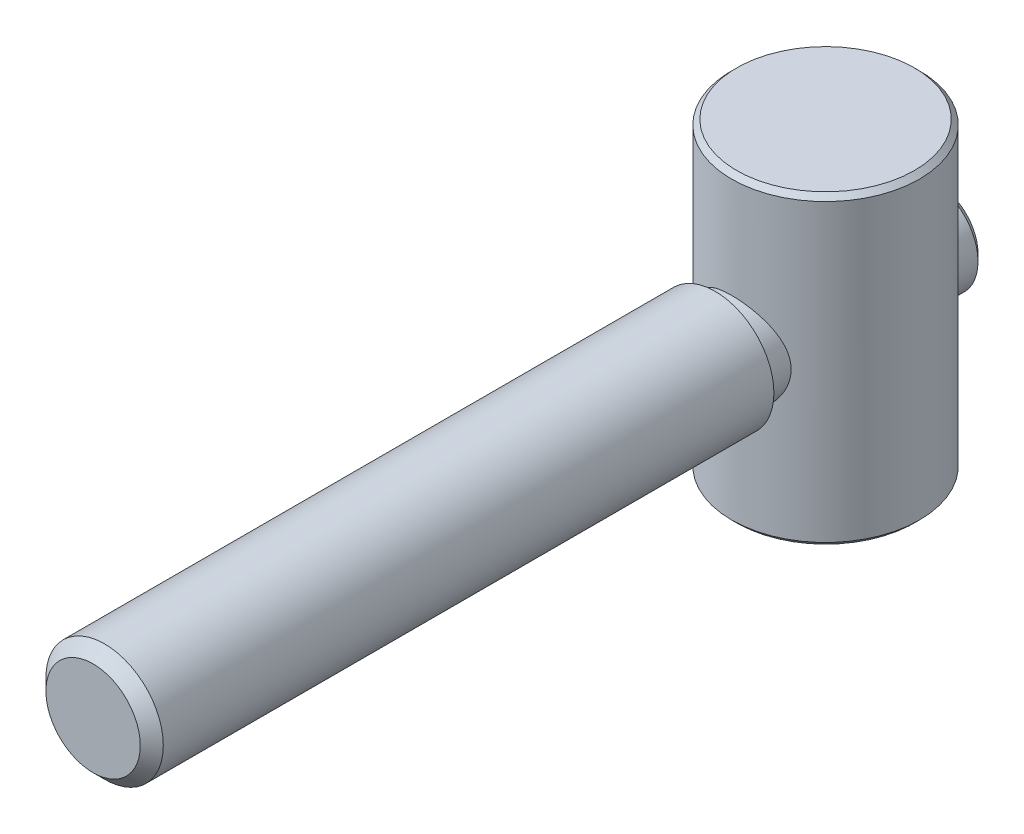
ISO-10303-21;
HEADER;
FILE_DESCRIPTION(('STEP AP214'),'2;1');
FILE_NAME('part.step','',(''),(''),'','','');
FILE_SCHEMA(('AUTOMOTIVE_DESIGN { 1 0 10303 214 1 1 1 1 }'));
ENDSEC;
DATA;
#1=APPLICATION_CONTEXT('core data for automotive mechanical design processes');
#2=APPLICATION_PROTOCOL_DEFINITION('international standard','automotive_design',2000,#1);
#3=PRODUCT_CONTEXT('',#1,'mechanical');
#4=PRODUCT('Part','Part','',(#3));
#5=PRODUCT_RELATED_PRODUCT_CATEGORY('part','',(#4));
#6=PRODUCT_DEFINITION_FORMATION('','',#4);
#7=PRODUCT_DEFINITION_CONTEXT('part definition',#1,'design');
#8=PRODUCT_DEFINITION('design','',#6,#7);
#9=PRODUCT_DEFINITION_SHAPE('','',#8);
#10=(LENGTH_UNIT() NAMED_UNIT(*) SI_UNIT(.MILLI.,.METRE.));
#11=(NAMED_UNIT(*) PLANE_ANGLE_UNIT() SI_UNIT($,.RADIAN.));
#12=(NAMED_UNIT(*) SI_UNIT($,.STERADIAN.) SOLID_ANGLE_UNIT());
#13=UNCERTAINTY_MEASURE_WITH_UNIT(LENGTH_MEASURE(1.E-05),#10,'distance_accuracy_value','');
#14=(GEOMETRIC_REPRESENTATION_CONTEXT(3) GLOBAL_UNCERTAINTY_ASSIGNED_CONTEXT((#13)) GLOBAL_UNIT_ASSIGNED_CONTEXT((#10,
#11,#12)) REPRESENTATION_CONTEXT('',''));
#15=CARTESIAN_POINT('',(0.,0.,0.));
#16=DIRECTION('',(0.,0.,1.));
#17=DIRECTION('',(1.,0.,0.));
#18=AXIS2_PLACEMENT_3D('',#15,#16,#17);
#19=CARTESIAN_POINT('',(0.,0.,-16.2));
#20=DIRECTION('',(0.,0.,1.));
#21=DIRECTION('',(1.,0.,0.));
#22=AXIS2_PLACEMENT_3D('',#19,#20,#21);
#23=PLANE('',#22);
#24=DIRECTION('',(0.,-1.,0.));
#25=VECTOR('',#24,1.);
#26=CARTESIAN_POINT('',(0.4,0.,-16.2));
#27=LINE('',#26,#25);
#28=CARTESIAN_POINT('',(0.4,1.64558264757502,-16.2));
#29=VERTEX_POINT('',#28);
#30=CARTESIAN_POINT('',(0.4,-1.64558264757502,-16.2));
#31=VERTEX_POINT('',#30);
#32=EDGE_CURVE('E116',#29,#31,#27,.T.);
#33=ORIENTED_EDGE('',*,*,#32,.F.);
#34=CARTESIAN_POINT('',(0.,0.,-16.2));
#35=DIRECTION('',(0.,0.,1.));
#36=DIRECTION('',(1.,0.,0.));
#37=AXIS2_PLACEMENT_3D('',#34,#35,#36);
#38=CIRCLE('',#37,1.6935);
#39=EDGE_CURVE('E233',#31,#29,#38,.T.);
#40=ORIENTED_EDGE('',*,*,#39,.F.);
#41=EDGE_LOOP('',(#33,#40));
#42=FACE_BOUND('',#41,.T.);
#43=ADVANCED_FACE('F14',(#42),#23,.F.);
#44=CARTESIAN_POINT('',(0.,0.,-16.2));
#45=DIRECTION('',(0.,0.,1.));
#46=DIRECTION('',(1.,0.,0.));
#47=AXIS2_PLACEMENT_3D('',#44,#45,#46);
#48=CONICAL_SURFACE('',#47,1.6935,0.785398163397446);
#49=CARTESIAN_POINT('',(0.4,1.96030622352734,-15.8928));
#50=CARTESIAN_POINT('',(0.4,1.91220040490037,-15.9399326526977));
#51=CARTESIAN_POINT('',(0.4,1.86406179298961,-15.987031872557));
#52=CARTESIAN_POINT('',(0.4,1.76762008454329,-16.0812165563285));
#53=CARTESIAN_POINT('',(0.4,1.71931684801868,-16.1283018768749));
#54=CARTESIAN_POINT('',(0.4,1.62128853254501,-16.2236371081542));
#55=CARTESIAN_POINT('',(0.4,1.5715604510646,-16.2718839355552));
#56=CARTESIAN_POINT('',(0.4,1.47203148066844,-16.3681410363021));
#57=CARTESIAN_POINT('',(0.4,1.42223083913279,-16.4161515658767));
#58=CARTESIAN_POINT('',(0.4,1.27910635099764,-16.5535705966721));
#59=CARTESIAN_POINT('',(0.4,1.18553880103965,-16.6427271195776));
#60=CARTESIAN_POINT('',(0.4,1.04389226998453,-16.7757107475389));
#61=CARTESIAN_POINT('',(0.4,0.996302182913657,-16.8200580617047));
#62=CARTESIAN_POINT('',(0.4,0.900663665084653,-16.908185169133));
#63=CARTESIAN_POINT('',(0.4,0.852615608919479,-16.9519653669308));
#64=CARTESIAN_POINT('',(0.4,0.757010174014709,-17.0375656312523));
#65=CARTESIAN_POINT('',(0.4,0.709472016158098,-17.0794071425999));
#66=CARTESIAN_POINT('',(0.4,0.613103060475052,-17.1618876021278));
#67=CARTESIAN_POINT('',(0.4,0.564268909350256,-17.202522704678));
#68=CARTESIAN_POINT('',(0.4,0.489794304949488,-17.2613006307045));
#69=CARTESIAN_POINT('',(0.4,0.464926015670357,-17.2804170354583));
#70=CARTESIAN_POINT('',(0.4,0.414504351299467,-17.317718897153));
#71=CARTESIAN_POINT('',(0.4,0.388951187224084,-17.3359046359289));
#72=CARTESIAN_POINT('',(0.4,0.337021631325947,-17.3708007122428));
#73=CARTESIAN_POINT('',(0.4,0.310649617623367,-17.387517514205));
#74=CARTESIAN_POINT('',(0.4,0.256646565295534,-17.4187557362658));
#75=CARTESIAN_POINT('',(0.4,0.229017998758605,-17.4332812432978));
#76=CARTESIAN_POINT('',(0.4,0.194529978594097,-17.4487382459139));
#77=CARTESIAN_POINT('',(0.4,0.188431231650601,-17.451374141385));
#78=CARTESIAN_POINT('',(0.4,0.176155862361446,-17.456465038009));
#79=CARTESIAN_POINT('',(0.4,0.169979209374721,-17.4589199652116));
#80=CARTESIAN_POINT('',(0.4,0.15133633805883,-17.4659833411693));
#81=CARTESIAN_POINT('',(0.4,0.138753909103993,-17.4702918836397));
#82=CARTESIAN_POINT('',(0.4,0.113503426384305,-17.4778793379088));
#83=CARTESIAN_POINT('',(0.4,0.100840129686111,-17.4811739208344));
#84=CARTESIAN_POINT('',(0.4,0.0752707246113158,-17.4866710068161));
#85=CARTESIAN_POINT('',(0.4,0.0623645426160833,-17.4888731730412));
#86=CARTESIAN_POINT('',(0.4,0.0361451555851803,-17.4920845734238));
#87=CARTESIAN_POINT('',(0.4,0.0228289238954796,-17.4930696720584));
#88=CARTESIAN_POINT('',(0.4,-0.00382941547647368,-17.4937047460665));
#89=CARTESIAN_POINT('',(0.4,-0.0171715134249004,-17.4933551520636));
#90=CARTESIAN_POINT('',(0.4,-0.0570913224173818,-17.4903112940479));
#91=CARTESIAN_POINT('',(0.4,-0.0835282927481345,-17.4856177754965));
#92=CARTESIAN_POINT('',(0.4,-0.144402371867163,-17.4695980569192));
#93=CARTESIAN_POINT('',(0.4,-0.178344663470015,-17.4565077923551));
#94=CARTESIAN_POINT('',(0.4,-0.227667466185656,-17.4334775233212));
#95=CARTESIAN_POINT('',(0.4,-0.24390093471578,-17.4251975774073));
#96=CARTESIAN_POINT('',(0.4,-0.275892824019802,-17.4077659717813));
#97=CARTESIAN_POINT('',(0.4,-0.29165139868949,-17.3986145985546));
#98=CARTESIAN_POINT('',(0.4,-0.342427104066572,-17.367697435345));
#99=CARTESIAN_POINT('',(0.4,-0.376624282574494,-17.3446006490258));
#100=CARTESIAN_POINT('',(0.4,-0.443707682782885,-17.2965614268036));
#101=CARTESIAN_POINT('',(0.4,-0.476592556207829,-17.2716171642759));
#102=CARTESIAN_POINT('',(0.4,-0.541555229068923,-17.2205373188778));
#103=CARTESIAN_POINT('',(0.4,-0.573630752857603,-17.1943988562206));
#104=CARTESIAN_POINT('',(0.4,-0.637167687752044,-17.1413834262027));
#105=CARTESIAN_POINT('',(0.4,-0.66862901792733,-17.1145063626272));
#106=CARTESIAN_POINT('',(0.4,-0.762581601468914,-17.0329492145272));
#107=CARTESIAN_POINT('',(0.4,-0.824422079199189,-16.9775217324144));
#108=CARTESIAN_POINT('',(0.4,-0.947059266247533,-16.865732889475));
#109=CARTESIAN_POINT('',(0.4,-1.0078575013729,-16.8093731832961));
#110=CARTESIAN_POINT('',(0.4,-1.14419995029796,-16.6816912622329));
#111=CARTESIAN_POINT('',(0.4,-1.21957997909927,-16.6101938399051));
#112=CARTESIAN_POINT('',(0.4,-1.36985690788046,-16.4666062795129));
#113=CARTESIAN_POINT('',(0.4,-1.444753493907,-16.3945158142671));
#114=CARTESIAN_POINT('',(0.4,-1.59323885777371,-16.2509244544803));
#115=CARTESIAN_POINT('',(0.4,-1.66683198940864,-16.1794280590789));
#116=CARTESIAN_POINT('',(0.4,-1.81374089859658,-16.0362433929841));
#117=CARTESIAN_POINT('',(0.4,-1.88705682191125,-15.9645552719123));
#118=CARTESIAN_POINT('',(0.4,-1.96030622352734,-15.8928));
#119=B_SPLINE_CURVE_WITH_KNOTS('',3,(#49,#50,#51,#52,#53,#54,#55,#56,#57,#58,#59,#60,#61,#62,
#63,#64,#65,#66,#67,#68,#69,#70,#71,#72,#73,#74,#75,#76,#77,#78,#79,#80,#81,#82,#83,#84,#85,#86,
#87,#88,#89,#90,#91,#92,#93,#94,#95,#96,#97,#98,#99,#100,#101,#102,#103,#104,#105,#106,#107,
#108,#109,#110,#111,#112,#113,#114,#115,#116,#117,#118),.UNSPECIFIED.,.F.,.F.,(4,2,2,2,2,2,2,2,
2,2,2,2,2,2,2,2,2,2,2,2,2,2,2,2,2,2,2,2,2,2,2,2,2,2,4),(0.,0.202041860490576,0.404407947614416,
0.612267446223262,0.819791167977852,1.20751042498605,1.40265824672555,1.59765821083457,
1.78763722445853,1.97816800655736,2.07225481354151,2.16631295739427,2.25993394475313,
2.35337810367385,2.37330754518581,2.39324508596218,2.4331093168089,2.47232228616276,
2.51154733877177,2.55153838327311,2.59151652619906,2.67157438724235,2.78007616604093,
2.83473709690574,2.88938011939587,3.01305301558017,3.13684986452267,3.26096287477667,
3.38509213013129,3.63419872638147,3.88290259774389,4.19457948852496,4.5064417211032,
4.81425453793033,5.1218730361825),.UNSPECIFIED.);
#120=CARTESIAN_POINT('',(0.4,1.95959179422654,-15.8935));
#121=VERTEX_POINT('',#120);
#122=EDGE_CURVE('E104',#121,#29,#119,.T.);
#123=ORIENTED_EDGE('',*,*,#122,.F.);
#124=CARTESIAN_POINT('',(0.,0.,-15.8935));
#125=DIRECTION('',(0.,0.,1.));
#126=DIRECTION('',(1.,0.,0.));
#127=AXIS2_PLACEMENT_3D('',#124,#125,#126);
#128=CIRCLE('',#127,2.);
#129=CARTESIAN_POINT('',(0.4,-1.95959179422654,-15.8935));
#130=VERTEX_POINT('',#129);
#131=EDGE_CURVE('E239',#130,#121,#128,.T.);
#132=ORIENTED_EDGE('',*,*,#131,.F.);
#133=EDGE_CURVE('E117',#31,#130,#119,.T.);
#134=ORIENTED_EDGE('',*,*,#133,.F.);
#135=ORIENTED_EDGE('',*,*,#39,.T.);
#136=EDGE_LOOP('',(#123,#132,#134,#135));
#137=FACE_BOUND('',#136,.T.);
#138=ADVANCED_FACE('F134',(#137),#48,.T.);
#139=CARTESIAN_POINT('',(-0.4,0.,-46.2));
#140=DIRECTION('',(1.,0.,0.));
#141=DIRECTION('',(0.,-1.,0.));
#142=AXIS2_PLACEMENT_3D('',#139,#140,#141);
#143=CYLINDRICAL_SURFACE('',#142,31.5);
#144=CARTESIAN_POINT('',(-0.4,0.,-46.2));
#145=DIRECTION('',(-1.,0.,0.));
#146=DIRECTION('',(0.,1.,0.));
#147=AXIS2_PLACEMENT_3D('',#144,#145,#146);
#148=CIRCLE('',#147,31.5);
#149=CARTESIAN_POINT('',(-0.4,-1.95959179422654,-14.7610114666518));
#150=VERTEX_POINT('',#149);
#151=CARTESIAN_POINT('',(-0.4,1.95959179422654,-14.7610114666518));
#152=VERTEX_POINT('',#151);
#153=EDGE_CURVE('E102',#150,#152,#148,.T.);
#154=ORIENTED_EDGE('',*,*,#153,.T.);
#155=CARTESIAN_POINT('',(-0.4,1.95959179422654,-14.7610114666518));
#156=CARTESIAN_POINT('',(-0.344561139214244,1.97091486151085,-14.7617184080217));
#157=CARTESIAN_POINT('',(-0.28863792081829,1.97987306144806,-14.762281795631));
#158=CARTESIAN_POINT('',(-0.176213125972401,1.99302430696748,-14.7631121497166));
#159=CARTESIAN_POINT('',(-0.119711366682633,1.99721579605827,-14.7633790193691));
#160=CARTESIAN_POINT('',(-0.00749894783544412,2.0007609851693,-14.7636046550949));
#161=CARTESIAN_POINT('',(0.0482092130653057,2.00019410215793,-14.7635684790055));
#162=CARTESIAN_POINT('',(0.159360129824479,1.99441663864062,-14.7632012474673));
#163=CARTESIAN_POINT('',(0.214802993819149,1.98920814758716,-14.7628703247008));
#164=CARTESIAN_POINT('',(0.313516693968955,1.97576492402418,-14.762023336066));
#165=CARTESIAN_POINT('',(0.356906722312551,1.96839158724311,-14.761560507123));
#166=CARTESIAN_POINT('',(0.4,1.95959179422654,-14.7610114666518));
#167=B_SPLINE_CURVE_WITH_KNOTS('',3,(#155,#156,#157,#158,#159,#160,#161,#162,#163,#164,#165,
#166),.UNSPECIFIED.,.F.,.F.,(4,2,2,2,2,4),(0.,0.169712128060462,0.33947965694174,
0.506419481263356,0.673284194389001,0.805229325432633),.UNSPECIFIED.);
#168=CARTESIAN_POINT('',(0.4,1.95959179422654,-14.7610114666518));
#169=VERTEX_POINT('',#168);
#170=EDGE_CURVE('E100',#152,#169,#167,.T.);
#171=ORIENTED_EDGE('',*,*,#170,.T.);
#172=CARTESIAN_POINT('',(0.4,0.,-46.2));
#173=DIRECTION('',(-1.,0.,0.));
#174=DIRECTION('',(0.,1.,0.));
#175=AXIS2_PLACEMENT_3D('',#172,#173,#174);
#176=CIRCLE('',#175,31.5);
#177=CARTESIAN_POINT('',(0.4,-1.95959179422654,-14.7610114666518));
#178=VERTEX_POINT('',#177);
#179=EDGE_CURVE('E86',#178,#169,#176,.T.);
#180=ORIENTED_EDGE('',*,*,#179,.F.);
#181=CARTESIAN_POINT('',(0.4,-1.95959179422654,-14.7610114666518));
#182=CARTESIAN_POINT('',(0.344561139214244,-1.97091486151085,-14.7617184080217));
#183=CARTESIAN_POINT('',(0.28863792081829,-1.97987306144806,-14.762281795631));
#184=CARTESIAN_POINT('',(0.176213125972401,-1.99302430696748,-14.7631121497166));
#185=CARTESIAN_POINT('',(0.119711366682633,-1.99721579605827,-14.7633790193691));
#186=CARTESIAN_POINT('',(0.00749894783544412,-2.0007609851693,-14.7636046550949));
#187=CARTESIAN_POINT('',(-0.0482092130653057,-2.00019410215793,-14.7635684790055));
#188=CARTESIAN_POINT('',(-0.159360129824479,-1.99441663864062,-14.7632012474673));
#189=CARTESIAN_POINT('',(-0.214802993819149,-1.98920814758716,-14.7628703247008));
#190=CARTESIAN_POINT('',(-0.313516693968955,-1.97576492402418,-14.762023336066));
#191=CARTESIAN_POINT('',(-0.356906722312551,-1.96839158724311,-14.761560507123));
#192=CARTESIAN_POINT('',(-0.4,-1.95959179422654,-14.7610114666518));
#193=B_SPLINE_CURVE_WITH_KNOTS('',3,(#181,#182,#183,#184,#185,#186,#187,#188,#189,#190,#191,
#192),.UNSPECIFIED.,.F.,.F.,(4,2,2,2,2,4),(0.,0.169712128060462,0.33947965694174,
0.506419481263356,0.673284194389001,0.805229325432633),.UNSPECIFIED.);
#194=EDGE_CURVE('E94',#178,#150,#193,.T.);
#195=ORIENTED_EDGE('',*,*,#194,.T.);
#196=EDGE_LOOP('',(#154,#171,#180,#195));
#197=FACE_BOUND('',#196,.T.);
#198=ADVANCED_FACE('F99',(#197),#143,.F.);
#199=CARTESIAN_POINT('',(0.,0.,-6.7));
#200=DIRECTION('',(0.,0.,1.));
#201=DIRECTION('',(1.,0.,0.));
#202=AXIS2_PLACEMENT_3D('',#199,#200,#201);
#203=CYLINDRICAL_SURFACE('',#202,2.);
#204=CARTESIAN_POINT('',(2.,0.,-14.8641016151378));
#205=CARTESIAN_POINT('',(1.99999158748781,0.104213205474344,-14.8641118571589));
#206=CARTESIAN_POINT('',(1.99179963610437,0.208562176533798,-14.8688763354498));
#207=CARTESIAN_POINT('',(1.95944672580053,0.414055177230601,-14.8872470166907));
#208=CARTESIAN_POINT('',(1.93525221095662,0.515192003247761,-14.9008717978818));
#209=CARTESIAN_POINT('',(1.8721998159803,0.710903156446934,-14.9349870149));
#210=CARTESIAN_POINT('',(1.83341988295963,0.80550925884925,-14.9554408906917));
#211=CARTESIAN_POINT('',(1.74253507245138,0.986848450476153,-15.0008532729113));
#212=CARTESIAN_POINT('',(1.69042947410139,1.07358111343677,-15.0258120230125));
#213=CARTESIAN_POINT('',(1.569333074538,1.24461144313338,-15.0799373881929));
#214=CARTESIAN_POINT('',(1.49930407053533,1.32811826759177,-15.109281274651));
#215=CARTESIAN_POINT('',(1.34650761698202,1.4828167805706,-15.1674396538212));
#216=CARTESIAN_POINT('',(1.26373385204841,1.55400232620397,-15.1962538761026));
#217=CARTESIAN_POINT('',(1.08097912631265,1.6867343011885,-15.2524295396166));
#218=CARTESIAN_POINT('',(0.980214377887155,1.74730753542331,-15.2795621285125));
#219=CARTESIAN_POINT('',(0.768314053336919,1.85028170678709,-15.3270151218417));
#220=CARTESIAN_POINT('',(0.657185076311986,1.8926941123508,-15.3473398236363));
#221=CARTESIAN_POINT('',(0.436089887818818,1.95500932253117,-15.3776092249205));
#222=CARTESIAN_POINT('',(0.326603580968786,1.9762990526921,-15.3881896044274));
#223=CARTESIAN_POINT('',(0.105141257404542,2.00033223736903,-15.4001516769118));
#224=CARTESIAN_POINT('',(-0.00683321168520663,2.00308691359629,-15.4015389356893));
#225=CARTESIAN_POINT('',(-0.219665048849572,1.99050665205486,-15.3952596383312));
#226=CARTESIAN_POINT('',(-0.320642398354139,1.97672396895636,-15.3883699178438));
#227=CARTESIAN_POINT('',(-0.518627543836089,1.93423831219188,-15.3674849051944));
#228=CARTESIAN_POINT('',(-0.615635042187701,1.90553422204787,-15.3534890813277));
#229=CARTESIAN_POINT('',(-0.804618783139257,1.83383486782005,-15.3194316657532));
#230=CARTESIAN_POINT('',(-0.896506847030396,1.79064737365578,-15.299288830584));
#231=CARTESIAN_POINT('',(-1.07195360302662,1.6914731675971,-15.2547529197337));
#232=CARTESIAN_POINT('',(-1.15550929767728,1.63548187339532,-15.2303583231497));
#233=CARTESIAN_POINT('',(-1.3203473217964,1.50620929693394,-15.1768878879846));
#234=CARTESIAN_POINT('',(-1.40066815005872,1.43179394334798,-15.1475875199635));
#235=CARTESIAN_POINT('',(-1.54820874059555,1.27082055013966,-15.0890868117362));
#236=CARTESIAN_POINT('',(-1.61541842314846,1.18425325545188,-15.0598865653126));
#237=CARTESIAN_POINT('',(-1.73901066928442,0.994703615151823,-15.0028831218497));
#238=CARTESIAN_POINT('',(-1.7944346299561,0.89102795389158,-14.9752863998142));
#239=CARTESIAN_POINT('',(-1.88663822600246,0.674124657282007,-14.9275090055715));
#240=CARTESIAN_POINT('',(-1.92343731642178,0.560907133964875,-14.9073206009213));
#241=CARTESIAN_POINT('',(-1.97436042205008,0.337570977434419,-14.8788927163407));
#242=CARTESIAN_POINT('',(-1.99005024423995,0.227917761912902,-14.8698331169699));
#243=CARTESIAN_POINT('',(-2.00303389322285,0.00719731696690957,-14.8623583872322));
#244=CARTESIAN_POINT('',(-2.00034071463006,-0.103868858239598,-14.8639357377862));
#245=CARTESIAN_POINT('',(-1.97807208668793,-0.311307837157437,-14.8766867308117));
#246=CARTESIAN_POINT('',(-1.96037563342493,-0.407958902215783,-14.8867917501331));
#247=CARTESIAN_POINT('',(-1.91139256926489,-0.596735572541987,-14.9138804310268));
#248=CARTESIAN_POINT('',(-1.88010155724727,-0.688859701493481,-14.9308663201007));
#249=CARTESIAN_POINT('',(-1.80329517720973,-0.870822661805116,-14.9707244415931));
#250=CARTESIAN_POINT('',(-1.7571881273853,-0.960358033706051,-14.9938328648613));
#251=CARTESIAN_POINT('',(-1.65257412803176,-1.13093854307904,-15.043122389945));
#252=CARTESIAN_POINT('',(-1.59406080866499,-1.21197928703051,-15.069305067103));
#253=CARTESIAN_POINT('',(-1.45767433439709,-1.37395753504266,-15.1257599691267));
#254=CARTESIAN_POINT('',(-1.37829054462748,-1.45359430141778,-15.1561316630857));
#255=CARTESIAN_POINT('',(-1.20680899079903,-1.59882447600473,-15.214684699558));
#256=CARTESIAN_POINT('',(-1.11470694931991,-1.66441314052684,-15.2428653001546));
#257=CARTESIAN_POINT('',(-0.917070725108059,-1.78114745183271,-15.2948272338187));
#258=CARTESIAN_POINT('',(-0.811246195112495,-1.83186623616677,-15.3184728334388));
#259=CARTESIAN_POINT('',(-0.591044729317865,-1.91427580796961,-15.3576670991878));
#260=CARTESIAN_POINT('',(-0.476675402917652,-1.9459833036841,-15.373222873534));
#261=CARTESIAN_POINT('',(-0.253959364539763,-1.98673712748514,-15.3933501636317));
#262=CARTESIAN_POINT('',(-0.1460228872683,-1.99759574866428,-15.3987985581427));
#263=CARTESIAN_POINT('',(0.0702519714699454,-2.00168653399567,-15.4008426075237));
#264=CARTESIAN_POINT('',(0.178590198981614,-1.99492486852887,-15.3974413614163));
#265=CARTESIAN_POINT('',(0.385075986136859,-1.96516717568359,-15.3826793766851));
#266=CARTESIAN_POINT('',(0.483424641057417,-1.94327026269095,-15.3718578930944));
#267=CARTESIAN_POINT('',(0.674891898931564,-1.88534604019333,-15.3438418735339));
#268=CARTESIAN_POINT('',(0.768009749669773,-1.84931670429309,-15.3266464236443));
#269=CARTESIAN_POINT('',(0.95084683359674,-1.7625457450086,-15.2865186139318));
#270=CARTESIAN_POINT('',(1.04025036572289,-1.71124078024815,-15.263372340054));
#271=CARTESIAN_POINT('',(1.20954920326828,-1.59608471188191,-15.2137626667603));
#272=CARTESIAN_POINT('',(1.28944011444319,-1.53222784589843,-15.1872977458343));
#273=CARTESIAN_POINT('',(1.44582833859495,-1.38640336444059,-15.1305721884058));
#274=CARTESIAN_POINT('',(1.52119665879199,-1.30326581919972,-15.1001959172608));
#275=CARTESIAN_POINT('',(1.65732528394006,-1.12510777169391,-15.0412615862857));
#276=CARTESIAN_POINT('',(1.71807266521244,-1.03007686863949,-15.0127051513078));
#277=CARTESIAN_POINT('',(1.82486714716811,-0.826691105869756,-14.9599918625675));
#278=CARTESIAN_POINT('',(1.87038902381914,-0.718010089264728,-14.9360025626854));
#279=CARTESIAN_POINT('',(1.92395929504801,-0.549421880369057,-14.9069621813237));
#280=CARTESIAN_POINT('',(1.93935666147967,-0.492352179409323,-14.898443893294));
#281=CARTESIAN_POINT('',(1.96508069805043,-0.376767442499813,-14.8840605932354));
#282=CARTESIAN_POINT('',(1.97541091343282,-0.318253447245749,-14.8781937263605));
#283=CARTESIAN_POINT('',(1.9887293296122,-0.21639921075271,-14.8705902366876));
#284=CARTESIAN_POINT('',(1.99295091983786,-0.173266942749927,-14.8681638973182));
#285=CARTESIAN_POINT('',(1.99858810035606,-0.0867643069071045,-14.8649174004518));
#286=CARTESIAN_POINT('',(2.00000350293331,-0.0433939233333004,-14.8640973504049));
#287=CARTESIAN_POINT('',(2.,0.,-14.8641016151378));
#288=B_SPLINE_CURVE_WITH_KNOTS('',3,(#204,#205,#206,#207,#208,#209,#210,#211,#212,#213,#214,
#215,#216,#217,#218,#219,#220,#221,#222,#223,#224,#225,#226,#227,#228,#229,#230,#231,#232,#233,
#234,#235,#236,#237,#238,#239,#240,#241,#242,#243,#244,#245,#246,#247,#248,#249,#250,#251,#252,
#253,#254,#255,#256,#257,#258,#259,#260,#261,#262,#263,#264,#265,#266,#267,#268,#269,#270,#271,
#272,#273,#274,#275,#276,#277,#278,#279,#280,#281,#282,#283,#284,#285,#286,#287),.UNSPECIFIED.,
.T.,.F.,(4,2,2,2,2,2,2,2,2,2,2,2,2,2,2,2,2,2,2,2,2,2,2,2,2,2,2,2,2,2,2,2,2,2,2,2,2,2,2,2,2,4),
(0.,0.312464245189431,0.625585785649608,0.937057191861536,1.24854545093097,1.58572462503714,
1.92307142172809,2.28315784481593,2.64301653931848,2.97726969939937,3.31132047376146,
3.61632194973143,3.92134625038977,4.2305906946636,4.5399459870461,4.87854382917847,
5.21740096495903,5.57777683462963,5.93777548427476,6.2692458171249,6.60048186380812,
6.89548366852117,7.19058104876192,7.49934592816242,7.80826972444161,8.15613487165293,
8.50411729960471,8.86128362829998,9.21813559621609,9.5422454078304,9.8662417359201,
10.1688884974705,10.4715786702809,10.7872150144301,11.102996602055,11.450204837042,
11.7977188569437,12.1562149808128,12.3351395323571,12.5139387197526,12.6440387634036,
12.7741475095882),.UNSPECIFIED.);
#289=CARTESIAN_POINT('',(0.4,-1.95959179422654,-15.3799497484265));
#290=VERTEX_POINT('',#289);
#291=CARTESIAN_POINT('',(0.4,1.95959179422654,-15.3799497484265));
#292=VERTEX_POINT('',#291);
#293=EDGE_CURVE('E24',#290,#292,#288,.T.);
#294=ORIENTED_EDGE('',*,*,#293,.F.);
#295=DIRECTION('',(0.,0.,1.));
#296=VECTOR('',#295,1.);
#297=CARTESIAN_POINT('',(0.4,-1.95959179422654,-6.7));
#298=LINE('',#297,#296);
#299=EDGE_CURVE('E88',#130,#290,#298,.T.);
#300=ORIENTED_EDGE('',*,*,#299,.F.);
#301=ORIENTED_EDGE('',*,*,#131,.T.);
#302=DIRECTION('',(0.,0.,1.));
#303=VECTOR('',#302,1.);
#304=CARTESIAN_POINT('',(0.4,1.95959179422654,-6.7));
#305=LINE('',#304,#303);
#306=EDGE_CURVE('E232',#292,#121,#305,.F.);
#307=ORIENTED_EDGE('',*,*,#306,.F.);
#308=EDGE_LOOP('',(#294,#300,#301,#307));
#309=FACE_BOUND('',#308,.T.);
#310=ADVANCED_FACE('F128',(#309),#203,.T.);
#311=CARTESIAN_POINT('',(0.4,0.,-46.2));
#312=DIRECTION('',(-1.,0.,0.));
#313=DIRECTION('',(0.,1.,0.));
#314=AXIS2_PLACEMENT_3D('',#311,#312,#313);
#315=PLANE('',#314);
#316=ORIENTED_EDGE('',*,*,#299,.T.);
#317=EDGE_CURVE('E82',#290,#178,#298,.T.);
#318=ORIENTED_EDGE('',*,*,#317,.T.);
#319=ORIENTED_EDGE('',*,*,#179,.T.);
#320=EDGE_CURVE('E235',#169,#292,#305,.F.);
#321=ORIENTED_EDGE('',*,*,#320,.T.);
#322=ORIENTED_EDGE('',*,*,#306,.T.);
#323=ORIENTED_EDGE('',*,*,#122,.T.);
#324=ORIENTED_EDGE('',*,*,#32,.T.);
#325=ORIENTED_EDGE('',*,*,#133,.T.);
#326=EDGE_LOOP('',(#316,#318,#319,#321,#322,#323,#324,#325));
#327=FACE_BOUND('',#326,.T.);
#328=ADVANCED_FACE('F84',(#327),#315,.T.);
#329=CARTESIAN_POINT('',(-0.4,1.95959179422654,-15.3799497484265));
#330=VERTEX_POINT('',#329);
#331=CARTESIAN_POINT('',(-0.4,-1.95959179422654,-15.3799497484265));
#332=VERTEX_POINT('',#331);
#333=EDGE_CURVE('E9',#330,#332,#288,.T.);
#334=ORIENTED_EDGE('',*,*,#333,.F.);
#335=DIRECTION('',(0.,0.,1.));
#336=VECTOR('',#335,1.);
#337=CARTESIAN_POINT('',(-0.4,1.95959179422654,-6.7));
#338=LINE('',#337,#336);
#339=CARTESIAN_POINT('',(-0.4,1.95959179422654,-15.8935));
#340=VERTEX_POINT('',#339);
#341=EDGE_CURVE('E242',#330,#340,#338,.F.);
#342=ORIENTED_EDGE('',*,*,#341,.T.);
#343=CARTESIAN_POINT('',(-0.4,-1.95959179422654,-15.8935));
#344=VERTEX_POINT('',#343);
#345=EDGE_CURVE('E237',#340,#344,#128,.T.);
#346=ORIENTED_EDGE('',*,*,#345,.T.);
#347=DIRECTION('',(0.,0.,1.));
#348=VECTOR('',#347,1.);
#349=CARTESIAN_POINT('',(-0.4,-1.95959179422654,-6.7));
#350=LINE('',#349,#348);
#351=EDGE_CURVE('E150',#344,#332,#350,.T.);
#352=ORIENTED_EDGE('',*,*,#351,.T.);
#353=EDGE_LOOP('',(#334,#342,#346,#352));
#354=FACE_BOUND('',#353,.T.);
#355=ADVANCED_FACE('F127',(#354),#203,.T.);
#356=CARTESIAN_POINT('',(-0.4,1.64558264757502,-16.2));
#357=VERTEX_POINT('',#356);
#358=CARTESIAN_POINT('',(-0.4,-1.64558264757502,-16.2));
#359=VERTEX_POINT('',#358);
#360=EDGE_CURVE('E228',#357,#359,#38,.T.);
#361=ORIENTED_EDGE('',*,*,#360,.F.);
#362=DIRECTION('',(0.,-1.,0.));
#363=VECTOR('',#362,1.);
#364=CARTESIAN_POINT('',(-0.4,0.,-16.2));
#365=LINE('',#364,#363);
#366=EDGE_CURVE('E229',#357,#359,#365,.T.);
#367=ORIENTED_EDGE('',*,*,#366,.T.);
#368=EDGE_LOOP('',(#361,#367));
#369=FACE_BOUND('',#368,.T.);
#370=ADVANCED_FACE('F155',(#369),#23,.F.);
#371=ORIENTED_EDGE('',*,*,#345,.F.);
#372=CARTESIAN_POINT('',(-0.4,1.96030622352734,-15.8928));
#373=CARTESIAN_POINT('',(-0.4,1.91220040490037,-15.9399326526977));
#374=CARTESIAN_POINT('',(-0.4,1.86406179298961,-15.987031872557));
#375=CARTESIAN_POINT('',(-0.4,1.76762008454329,-16.0812165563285));
#376=CARTESIAN_POINT('',(-0.4,1.71931684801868,-16.1283018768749));
#377=CARTESIAN_POINT('',(-0.4,1.62128853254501,-16.2236371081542));
#378=CARTESIAN_POINT('',(-0.4,1.5715604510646,-16.2718839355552));
#379=CARTESIAN_POINT('',(-0.4,1.47203148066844,-16.3681410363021));
#380=CARTESIAN_POINT('',(-0.4,1.42223083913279,-16.4161515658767));
#381=CARTESIAN_POINT('',(-0.4,1.27910635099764,-16.5535705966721));
#382=CARTESIAN_POINT('',(-0.4,1.18553880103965,-16.6427271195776));
#383=CARTESIAN_POINT('',(-0.4,1.04389226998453,-16.7757107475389));
#384=CARTESIAN_POINT('',(-0.4,0.996302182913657,-16.8200580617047));
#385=CARTESIAN_POINT('',(-0.4,0.900663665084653,-16.908185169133));
#386=CARTESIAN_POINT('',(-0.4,0.852615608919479,-16.9519653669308));
#387=CARTESIAN_POINT('',(-0.4,0.757010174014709,-17.0375656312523));
#388=CARTESIAN_POINT('',(-0.4,0.709472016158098,-17.0794071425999));
#389=CARTESIAN_POINT('',(-0.4,0.613103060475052,-17.1618876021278));
#390=CARTESIAN_POINT('',(-0.4,0.564268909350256,-17.202522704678));
#391=CARTESIAN_POINT('',(-0.4,0.489794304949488,-17.2613006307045));
#392=CARTESIAN_POINT('',(-0.4,0.464926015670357,-17.2804170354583));
#393=CARTESIAN_POINT('',(-0.4,0.414504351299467,-17.317718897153));
#394=CARTESIAN_POINT('',(-0.4,0.388951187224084,-17.3359046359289));
#395=CARTESIAN_POINT('',(-0.4,0.337021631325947,-17.3708007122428));
#396=CARTESIAN_POINT('',(-0.4,0.310649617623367,-17.387517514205));
#397=CARTESIAN_POINT('',(-0.4,0.256646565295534,-17.4187557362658));
#398=CARTESIAN_POINT('',(-0.4,0.229017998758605,-17.4332812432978));
#399=CARTESIAN_POINT('',(-0.4,0.194529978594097,-17.4487382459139));
#400=CARTESIAN_POINT('',(-0.4,0.188431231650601,-17.451374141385));
#401=CARTESIAN_POINT('',(-0.4,0.176155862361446,-17.456465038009));
#402=CARTESIAN_POINT('',(-0.4,0.169979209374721,-17.4589199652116));
#403=CARTESIAN_POINT('',(-0.4,0.15133633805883,-17.4659833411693));
#404=CARTESIAN_POINT('',(-0.4,0.138753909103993,-17.4702918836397));
#405=CARTESIAN_POINT('',(-0.4,0.113503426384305,-17.4778793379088));
#406=CARTESIAN_POINT('',(-0.4,0.100840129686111,-17.4811739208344));
#407=CARTESIAN_POINT('',(-0.4,0.0752707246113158,-17.4866710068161));
#408=CARTESIAN_POINT('',(-0.4,0.0623645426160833,-17.4888731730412));
#409=CARTESIAN_POINT('',(-0.4,0.0361451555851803,-17.4920845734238));
#410=CARTESIAN_POINT('',(-0.4,0.0228289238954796,-17.4930696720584));
#411=CARTESIAN_POINT('',(-0.4,-0.00382941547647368,-17.4937047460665));
#412=CARTESIAN_POINT('',(-0.4,-0.0171715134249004,-17.4933551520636));
#413=CARTESIAN_POINT('',(-0.4,-0.0570913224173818,-17.4903112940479));
#414=CARTESIAN_POINT('',(-0.4,-0.0835282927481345,-17.4856177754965));
#415=CARTESIAN_POINT('',(-0.4,-0.144402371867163,-17.4695980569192));
#416=CARTESIAN_POINT('',(-0.4,-0.178344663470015,-17.4565077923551));
#417=CARTESIAN_POINT('',(-0.4,-0.227667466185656,-17.4334775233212));
#418=CARTESIAN_POINT('',(-0.4,-0.24390093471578,-17.4251975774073));
#419=CARTESIAN_POINT('',(-0.4,-0.275892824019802,-17.4077659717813));
#420=CARTESIAN_POINT('',(-0.4,-0.29165139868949,-17.3986145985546));
#421=CARTESIAN_POINT('',(-0.4,-0.342427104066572,-17.367697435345));
#422=CARTESIAN_POINT('',(-0.4,-0.376624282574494,-17.3446006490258));
#423=CARTESIAN_POINT('',(-0.4,-0.443707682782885,-17.2965614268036));
#424=CARTESIAN_POINT('',(-0.4,-0.476592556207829,-17.2716171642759));
#425=CARTESIAN_POINT('',(-0.4,-0.541555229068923,-17.2205373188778));
#426=CARTESIAN_POINT('',(-0.4,-0.573630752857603,-17.1943988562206));
#427=CARTESIAN_POINT('',(-0.4,-0.637167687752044,-17.1413834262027));
#428=CARTESIAN_POINT('',(-0.4,-0.66862901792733,-17.1145063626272));
#429=CARTESIAN_POINT('',(-0.4,-0.762581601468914,-17.0329492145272));
#430=CARTESIAN_POINT('',(-0.4,-0.824422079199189,-16.9775217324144));
#431=CARTESIAN_POINT('',(-0.4,-0.947059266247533,-16.865732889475));
#432=CARTESIAN_POINT('',(-0.4,-1.0078575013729,-16.8093731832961));
#433=CARTESIAN_POINT('',(-0.4,-1.14419995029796,-16.6816912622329));
#434=CARTESIAN_POINT('',(-0.4,-1.21957997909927,-16.6101938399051));
#435=CARTESIAN_POINT('',(-0.4,-1.36985690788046,-16.4666062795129));
#436=CARTESIAN_POINT('',(-0.4,-1.444753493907,-16.3945158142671));
#437=CARTESIAN_POINT('',(-0.4,-1.59323885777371,-16.2509244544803));
#438=CARTESIAN_POINT('',(-0.4,-1.66683198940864,-16.1794280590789));
#439=CARTESIAN_POINT('',(-0.4,-1.81374089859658,-16.0362433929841));
#440=CARTESIAN_POINT('',(-0.4,-1.88705682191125,-15.9645552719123));
#441=CARTESIAN_POINT('',(-0.4,-1.96030622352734,-15.8928));
#442=B_SPLINE_CURVE_WITH_KNOTS('',3,(#372,#373,#374,#375,#376,#377,#378,#379,#380,#381,#382,
#383,#384,#385,#386,#387,#388,#389,#390,#391,#392,#393,#394,#395,#396,#397,#398,#399,#400,#401,
#402,#403,#404,#405,#406,#407,#408,#409,#410,#411,#412,#413,#414,#415,#416,#417,#418,#419,#420,
#421,#422,#423,#424,#425,#426,#427,#428,#429,#430,#431,#432,#433,#434,#435,#436,#437,#438,#439,
#440,#441),.UNSPECIFIED.,.F.,.F.,(4,2,2,2,2,2,2,2,2,2,2,2,2,2,2,2,2,2,2,2,2,2,2,2,2,2,2,2,2,2,2,
2,2,2,4),(0.,0.202041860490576,0.404407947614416,0.612267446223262,0.819791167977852,
1.20751042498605,1.40265824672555,1.59765821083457,1.78763722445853,1.97816800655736,
2.07225481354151,2.16631295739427,2.25993394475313,2.35337810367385,2.37330754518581,
2.39324508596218,2.4331093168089,2.47232228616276,2.51154733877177,2.55153838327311,
2.59151652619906,2.67157438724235,2.78007616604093,2.83473709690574,2.88938011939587,
3.01305301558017,3.13684986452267,3.26096287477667,3.38509213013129,3.63419872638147,
3.88290259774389,4.19457948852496,4.5064417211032,4.81425453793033,5.1218730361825),.UNSPECIFIED.);
#443=EDGE_CURVE('E251',#340,#357,#442,.T.);
#444=ORIENTED_EDGE('',*,*,#443,.T.);
#445=ORIENTED_EDGE('',*,*,#360,.T.);
#446=EDGE_CURVE('E253',#359,#344,#442,.T.);
#447=ORIENTED_EDGE('',*,*,#446,.T.);
#448=EDGE_LOOP('',(#371,#444,#445,#447));
#449=FACE_BOUND('',#448,.T.);
#450=ADVANCED_FACE('F119',(#449),#48,.T.);
#451=CARTESIAN_POINT('',(-0.4,0.,-46.2));
#452=DIRECTION('',(-1.,0.,0.));
#453=DIRECTION('',(0.,1.,0.));
#454=AXIS2_PLACEMENT_3D('',#451,#452,#453);
#455=PLANE('',#454);
#456=ORIENTED_EDGE('',*,*,#446,.F.);
#457=ORIENTED_EDGE('',*,*,#366,.F.);
#458=ORIENTED_EDGE('',*,*,#443,.F.);
#459=ORIENTED_EDGE('',*,*,#341,.F.);
#460=EDGE_CURVE('E92',#152,#330,#338,.F.);
#461=ORIENTED_EDGE('',*,*,#460,.F.);
#462=ORIENTED_EDGE('',*,*,#153,.F.);
#463=EDGE_CURVE('E32',#332,#150,#350,.T.);
#464=ORIENTED_EDGE('',*,*,#463,.F.);
#465=ORIENTED_EDGE('',*,*,#351,.F.);
#466=EDGE_LOOP('',(#456,#457,#458,#459,#461,#462,#464,#465));
#467=FACE_BOUND('',#466,.T.);
#468=ADVANCED_FACE('F129',(#467),#455,.F.);
#469=CARTESIAN_POINT('',(0.,0.,-6.7));
#470=DIRECTION('',(0.,0.,1.));
#471=DIRECTION('',(1.,0.,0.));
#472=AXIS2_PLACEMENT_3D('',#469,#470,#471);
#473=CIRCLE('',#472,2.);
#474=CARTESIAN_POINT('',(2.,0.,-6.7));
#475=VERTEX_POINT('',#474);
#476=EDGE_CURVE('E255',#475,#475,#473,.T.);
#477=ORIENTED_EDGE('',*,*,#476,.F.);
#478=EDGE_LOOP('',(#477));
#479=FACE_BOUND('',#478,.T.);
#480=CARTESIAN_POINT('',(2.,0.,-7.93589838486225));
#481=CARTESIAN_POINT('',(1.99999158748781,-0.104213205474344,-7.93588814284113));
#482=CARTESIAN_POINT('',(1.99179963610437,-0.208562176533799,-7.93112366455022));
#483=CARTESIAN_POINT('',(1.95944672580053,-0.414055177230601,-7.91275298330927));
#484=CARTESIAN_POINT('',(1.93525221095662,-0.515192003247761,-7.89912820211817));
#485=CARTESIAN_POINT('',(1.8721998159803,-0.710903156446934,-7.86501298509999));
#486=CARTESIAN_POINT('',(1.83341988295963,-0.80550925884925,-7.84455910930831));
#487=CARTESIAN_POINT('',(1.74253507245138,-0.986848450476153,-7.79914672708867));
#488=CARTESIAN_POINT('',(1.69042947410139,-1.07358111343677,-7.77418797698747));
#489=CARTESIAN_POINT('',(1.569333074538,-1.24461144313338,-7.72006261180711));
#490=CARTESIAN_POINT('',(1.49930407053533,-1.32811826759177,-7.69071872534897));
#491=CARTESIAN_POINT('',(1.34650761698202,-1.4828167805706,-7.63256034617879));
#492=CARTESIAN_POINT('',(1.26373385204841,-1.55400232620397,-7.60374612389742));
#493=CARTESIAN_POINT('',(1.08097912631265,-1.6867343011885,-7.5475704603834));
#494=CARTESIAN_POINT('',(0.980214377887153,-1.74730753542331,-7.52043787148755));
#495=CARTESIAN_POINT('',(0.768314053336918,-1.85028170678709,-7.47298487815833));
#496=CARTESIAN_POINT('',(0.657185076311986,-1.8926941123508,-7.45266017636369));
#497=CARTESIAN_POINT('',(0.436089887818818,-1.95500932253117,-7.42239077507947));
#498=CARTESIAN_POINT('',(0.326603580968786,-1.9762990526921,-7.4118103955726));
#499=CARTESIAN_POINT('',(0.105141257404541,-2.00033223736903,-7.39984832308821));
#500=CARTESIAN_POINT('',(-0.00683321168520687,-2.00308691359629,-7.39846106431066));
#501=CARTESIAN_POINT('',(-0.219665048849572,-1.99050665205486,-7.40474036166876));
#502=CARTESIAN_POINT('',(-0.320642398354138,-1.97672396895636,-7.41163008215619));
#503=CARTESIAN_POINT('',(-0.518627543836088,-1.93423831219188,-7.43251509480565));
#504=CARTESIAN_POINT('',(-0.6156350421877,-1.90553422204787,-7.44651091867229));
#505=CARTESIAN_POINT('',(-0.804618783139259,-1.83383486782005,-7.48056833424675));
#506=CARTESIAN_POINT('',(-0.896506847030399,-1.79064737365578,-7.50071116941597));
#507=CARTESIAN_POINT('',(-1.07195360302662,-1.6914731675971,-7.5452470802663));
#508=CARTESIAN_POINT('',(-1.15550929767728,-1.63548187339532,-7.56964167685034));
#509=CARTESIAN_POINT('',(-1.3203473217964,-1.50620929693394,-7.62311211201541));
#510=CARTESIAN_POINT('',(-1.40066815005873,-1.43179394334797,-7.6524124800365));
#511=CARTESIAN_POINT('',(-1.54820874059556,-1.27082055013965,-7.71091318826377));
#512=CARTESIAN_POINT('',(-1.61541842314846,-1.18425325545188,-7.74011343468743));
#513=CARTESIAN_POINT('',(-1.73901066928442,-0.994703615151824,-7.79711687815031));
#514=CARTESIAN_POINT('',(-1.7944346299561,-0.891027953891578,-7.82471360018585));
#515=CARTESIAN_POINT('',(-1.88663822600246,-0.674124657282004,-7.87249099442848));
#516=CARTESIAN_POINT('',(-1.92343731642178,-0.560907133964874,-7.89267939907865));
#517=CARTESIAN_POINT('',(-1.97436042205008,-0.33757097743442,-7.92110728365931));
#518=CARTESIAN_POINT('',(-1.99005024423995,-0.227917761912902,-7.93016688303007));
#519=CARTESIAN_POINT('',(-2.00303389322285,-0.00719731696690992,-7.93764161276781));
#520=CARTESIAN_POINT('',(-2.00034071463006,0.103868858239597,-7.93606426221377));
#521=CARTESIAN_POINT('',(-1.97807208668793,0.311307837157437,-7.9233132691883));
#522=CARTESIAN_POINT('',(-1.96037563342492,0.407958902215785,-7.91320824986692));
#523=CARTESIAN_POINT('',(-1.91139256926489,0.596735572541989,-7.88611956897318));
#524=CARTESIAN_POINT('',(-1.88010155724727,0.688859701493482,-7.86913367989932));
#525=CARTESIAN_POINT('',(-1.80329517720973,0.870822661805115,-7.82927555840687));
#526=CARTESIAN_POINT('',(-1.7571881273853,0.960358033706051,-7.80616713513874));
#527=CARTESIAN_POINT('',(-1.65257412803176,1.13093854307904,-7.756877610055));
#528=CARTESIAN_POINT('',(-1.59406080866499,1.21197928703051,-7.73069493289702));
#529=CARTESIAN_POINT('',(-1.45767433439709,1.37395753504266,-7.67424003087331));
#530=CARTESIAN_POINT('',(-1.37829054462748,1.45359430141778,-7.64386833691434));
#531=CARTESIAN_POINT('',(-1.20680899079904,1.59882447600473,-7.58531530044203));
#532=CARTESIAN_POINT('',(-1.11470694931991,1.66441314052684,-7.55713469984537));
#533=CARTESIAN_POINT('',(-0.917070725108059,1.78114745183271,-7.50517276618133));
#534=CARTESIAN_POINT('',(-0.811246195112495,1.83186623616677,-7.48152716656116));
#535=CARTESIAN_POINT('',(-0.591044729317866,1.91427580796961,-7.44233290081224));
#536=CARTESIAN_POINT('',(-0.476675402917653,1.9459833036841,-7.42677712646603));
#537=CARTESIAN_POINT('',(-0.253959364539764,1.98673712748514,-7.40664983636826));
#538=CARTESIAN_POINT('',(-0.1460228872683,1.99759574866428,-7.4012014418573));
#539=CARTESIAN_POINT('',(0.0702519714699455,2.00168653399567,-7.39915739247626));
#540=CARTESIAN_POINT('',(0.178590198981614,1.99492486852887,-7.40255863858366));
#541=CARTESIAN_POINT('',(0.385075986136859,1.96516717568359,-7.41732062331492));
#542=CARTESIAN_POINT('',(0.483424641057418,1.94327026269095,-7.42814210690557));
#543=CARTESIAN_POINT('',(0.674891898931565,1.88534604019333,-7.45615812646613));
#544=CARTESIAN_POINT('',(0.768009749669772,1.84931670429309,-7.47335357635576));
#545=CARTESIAN_POINT('',(0.950846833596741,1.7625457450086,-7.51348138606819));
#546=CARTESIAN_POINT('',(1.0402503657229,1.71124078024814,-7.53662765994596));
#547=CARTESIAN_POINT('',(1.20954920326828,1.59608471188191,-7.58623733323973));
#548=CARTESIAN_POINT('',(1.28944011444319,1.53222784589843,-7.61270225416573));
#549=CARTESIAN_POINT('',(1.44582833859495,1.38640336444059,-7.66942781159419));
#550=CARTESIAN_POINT('',(1.52119665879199,1.30326581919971,-7.69980408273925));
#551=CARTESIAN_POINT('',(1.65732528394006,1.12510777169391,-7.75873841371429));
#552=CARTESIAN_POINT('',(1.71807266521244,1.03007686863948,-7.78729484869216));
#553=CARTESIAN_POINT('',(1.82486714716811,0.826691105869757,-7.84000813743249));
#554=CARTESIAN_POINT('',(1.87038902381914,0.718010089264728,-7.86399743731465));
#555=CARTESIAN_POINT('',(1.92395929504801,0.549421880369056,-7.8930378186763));
#556=CARTESIAN_POINT('',(1.93935666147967,0.492352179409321,-7.90155610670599));
#557=CARTESIAN_POINT('',(1.96508069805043,0.376767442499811,-7.91593940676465));
#558=CARTESIAN_POINT('',(1.97541091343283,0.318253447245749,-7.9218062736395));
#559=CARTESIAN_POINT('',(1.9887293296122,0.21639921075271,-7.92940976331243));
#560=CARTESIAN_POINT('',(1.99295091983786,0.173266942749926,-7.93183610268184));
#561=CARTESIAN_POINT('',(1.99858810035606,0.086764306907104,-7.93508259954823));
#562=CARTESIAN_POINT('',(2.00000350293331,0.0433939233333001,-7.93590264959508));
#563=CARTESIAN_POINT('',(2.,0.,-7.93589838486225));
#564=B_SPLINE_CURVE_WITH_KNOTS('',3,(#480,#481,#482,#483,#484,#485,#486,#487,#488,#489,#490,
#491,#492,#493,#494,#495,#496,#497,#498,#499,#500,#501,#502,#503,#504,#505,#506,#507,#508,#509,
#510,#511,#512,#513,#514,#515,#516,#517,#518,#519,#520,#521,#522,#523,#524,#525,#526,#527,#528,
#529,#530,#531,#532,#533,#534,#535,#536,#537,#538,#539,#540,#541,#542,#543,#544,#545,#546,#547,
#548,#549,#550,#551,#552,#553,#554,#555,#556,#557,#558,#559,#560,#561,#562,#563),.UNSPECIFIED.,
.T.,.F.,(4,2,2,2,2,2,2,2,2,2,2,2,2,2,2,2,2,2,2,2,2,2,2,2,2,2,2,2,2,2,2,2,2,2,2,2,2,2,2,2,2,4),
(0.,0.312464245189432,0.62558578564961,0.937057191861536,1.24854545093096,1.58572462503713,
1.92307142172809,2.28315784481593,2.64301653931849,2.97726969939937,3.31132047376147,
3.61632194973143,3.92134625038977,4.2305906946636,4.53994598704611,4.87854382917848,
5.21740096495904,5.57777683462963,5.93777548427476,6.2692458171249,6.60048186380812,
6.89548366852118,7.19058104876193,7.49934592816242,7.80826972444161,8.15613487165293,
8.50411729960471,8.86128362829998,9.2181355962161,9.5422454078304,9.8662417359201,
10.1688884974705,10.4715786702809,10.7872150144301,11.102996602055,11.450204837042,
11.7977188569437,12.1562149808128,12.3351395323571,12.5139387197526,12.6440387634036,
12.7741475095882),.UNSPECIFIED.);
#565=CARTESIAN_POINT('',(2.,0.,-7.93589838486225));
#566=VERTEX_POINT('',#565);
#567=EDGE_CURVE('E162',#566,#566,#564,.T.);
#568=ORIENTED_EDGE('',*,*,#567,.F.);
#569=EDGE_LOOP('',(#568));
#570=FACE_BOUND('',#569,.T.);
#571=ADVANCED_FACE('F156',(#479,#570),#203,.T.);
#572=CARTESIAN_POINT('',(0.,0.,-6.7));
#573=DIRECTION('',(0.,0.,1.));
#574=DIRECTION('',(1.,0.,0.));
#575=AXIS2_PLACEMENT_3D('',#572,#573,#574);
#576=PLANE('',#575);
#577=CARTESIAN_POINT('',(0.,0.,-6.7));
#578=DIRECTION('',(0.,0.,1.));
#579=DIRECTION('',(1.,0.,0.));
#580=AXIS2_PLACEMENT_3D('',#577,#578,#579);
#581=CIRCLE('',#580,2.5);
#582=CARTESIAN_POINT('',(2.5,0.,-6.7));
#583=VERTEX_POINT('',#582);
#584=EDGE_CURVE('E259',#583,#583,#581,.T.);
#585=ORIENTED_EDGE('',*,*,#584,.F.);
#586=EDGE_LOOP('',(#585));
#587=FACE_BOUND('',#586,.T.);
#588=ORIENTED_EDGE('',*,*,#476,.T.);
#589=EDGE_LOOP('',(#588));
#590=FACE_BOUND('',#589,.T.);
#591=ADVANCED_FACE('F157',(#587,#590),#576,.F.);
#592=CARTESIAN_POINT('',(0.,0.,-0.200000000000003));
#593=DIRECTION('',(0.,0.,1.));
#594=DIRECTION('',(1.,0.,0.));
#595=AXIS2_PLACEMENT_3D('',#592,#593,#594);
#596=CYLINDRICAL_SURFACE('',#595,2.5);
#597=CARTESIAN_POINT('',(0.,0.,19.3095));
#598=DIRECTION('',(0.,0.,1.));
#599=DIRECTION('',(1.,0.,0.));
#600=AXIS2_PLACEMENT_3D('',#597,#598,#599);
#601=CIRCLE('',#600,2.5);
#602=CARTESIAN_POINT('',(2.5,0.,19.3095));
#603=VERTEX_POINT('',#602);
#604=EDGE_CURVE('E263',#603,#603,#601,.T.);
#605=ORIENTED_EDGE('',*,*,#604,.F.);
#606=EDGE_LOOP('',(#605));
#607=FACE_BOUND('',#606,.T.);
#608=ORIENTED_EDGE('',*,*,#584,.T.);
#609=EDGE_LOOP('',(#608));
#610=FACE_BOUND('',#609,.T.);
#611=ADVANCED_FACE('F281',(#607,#610),#596,.T.);
#612=CARTESIAN_POINT('',(0.,0.,19.3095));
#613=DIRECTION('',(0.,0.,-1.));
#614=DIRECTION('',(-1.,0.,0.));
#615=AXIS2_PLACEMENT_3D('',#612,#613,#614);
#616=CONICAL_SURFACE('',#615,2.5,0.785398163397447);
#617=CARTESIAN_POINT('',(0.,0.,19.8));
#618=DIRECTION('',(0.,0.,1.));
#619=DIRECTION('',(1.,0.,0.));
#620=AXIS2_PLACEMENT_3D('',#617,#618,#619);
#621=CIRCLE('',#620,2.0095);
#622=CARTESIAN_POINT('',(2.0095,0.,19.8));
#623=VERTEX_POINT('',#622);
#624=EDGE_CURVE('E268',#623,#623,#621,.T.);
#625=ORIENTED_EDGE('',*,*,#624,.F.);
#626=EDGE_LOOP('',(#625));
#627=FACE_BOUND('',#626,.T.);
#628=ORIENTED_EDGE('',*,*,#604,.T.);
#629=EDGE_LOOP('',(#628));
#630=FACE_BOUND('',#629,.T.);
#631=ADVANCED_FACE('F278',(#627,#630),#616,.T.);
#632=CARTESIAN_POINT('',(2.0095,0.,19.8));
#633=DIRECTION('',(0.,0.,-1.));
#634=DIRECTION('',(-1.,0.,0.));
#635=AXIS2_PLACEMENT_3D('',#632,#633,#634);
#636=PLANE('',#635);
#637=ORIENTED_EDGE('',*,*,#624,.T.);
#638=EDGE_LOOP('',(#637));
#639=FACE_BOUND('',#638,.T.);
#640=ADVANCED_FACE('F135',(#639),#636,.F.);
#641=CARTESIAN_POINT('',(0.,-6.5,-11.4));
#642=DIRECTION('',(0.,-1.,0.));
#643=DIRECTION('',(-1.,0.,0.));
#644=AXIS2_PLACEMENT_3D('',#641,#642,#643);
#645=PLANE('',#644);
#646=CARTESIAN_POINT('',(0.,-6.5,-11.4));
#647=DIRECTION('',(0.,-1.,0.));
#648=DIRECTION('',(-1.,0.,0.));
#649=AXIS2_PLACEMENT_3D('',#646,#647,#648);
#650=CIRCLE('',#649,3.78786796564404);
#651=CARTESIAN_POINT('',(-3.78786796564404,-6.5,-11.4));
#652=VERTEX_POINT('',#651);
#653=EDGE_CURVE('E19',#652,#652,#650,.T.);
#654=ORIENTED_EDGE('',*,*,#653,.T.);
#655=EDGE_LOOP('',(#654));
#656=FACE_BOUND('',#655,.T.);
#657=ADVANCED_FACE('F178',(#656),#645,.T.);
#658=CARTESIAN_POINT('',(0.,6.5,-11.4));
#659=DIRECTION('',(0.,1.,0.));
#660=DIRECTION('',(1.,0.,0.));
#661=AXIS2_PLACEMENT_3D('',#658,#659,#660);
#662=PLANE('',#661);
#663=CARTESIAN_POINT('',(0.,6.5,-11.4));
#664=DIRECTION('',(0.,1.,0.));
#665=DIRECTION('',(1.,0.,0.));
#666=AXIS2_PLACEMENT_3D('',#663,#664,#665);
#667=CIRCLE('',#666,3.78786796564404);
#668=CARTESIAN_POINT('',(3.78786796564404,6.5,-11.4));
#669=VERTEX_POINT('',#668);
#670=EDGE_CURVE('E189',#669,#669,#667,.T.);
#671=ORIENTED_EDGE('',*,*,#670,.T.);
#672=EDGE_LOOP('',(#671));
#673=FACE_BOUND('',#672,.T.);
#674=ADVANCED_FACE('F196',(#673),#662,.T.);
#675=CARTESIAN_POINT('',(0.,-6.5,-11.4));
#676=DIRECTION('',(0.,1.,0.));
#677=DIRECTION('',(1.,0.,0.));
#678=AXIS2_PLACEMENT_3D('',#675,#676,#677);
#679=CONICAL_SURFACE('',#678,3.78786796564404,0.785398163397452);
#680=CARTESIAN_POINT('',(0.,-6.28786796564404,-11.4));
#681=DIRECTION('',(0.,-1.,0.));
#682=DIRECTION('',(-1.,0.,0.));
#683=AXIS2_PLACEMENT_3D('',#680,#681,#682);
#684=CIRCLE('',#683,4.);
#685=CARTESIAN_POINT('',(-4.,-6.28786796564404,-11.4));
#686=VERTEX_POINT('',#685);
#687=EDGE_CURVE('E434',#686,#686,#684,.F.);
#688=ORIENTED_EDGE('',*,*,#687,.F.);
#689=EDGE_LOOP('',(#688));
#690=FACE_BOUND('',#689,.T.);
#691=ORIENTED_EDGE('',*,*,#653,.F.);
#692=EDGE_LOOP('',(#691));
#693=FACE_BOUND('',#692,.T.);
#694=ADVANCED_FACE('F17',(#690,#693),#679,.T.);
#695=CARTESIAN_POINT('',(0.,6.5,-11.4));
#696=DIRECTION('',(0.,-1.,0.));
#697=DIRECTION('',(-1.,0.,0.));
#698=AXIS2_PLACEMENT_3D('',#695,#696,#697);
#699=CONICAL_SURFACE('',#698,3.78786796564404,0.78539816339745);
#700=CARTESIAN_POINT('',(0.,6.28786796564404,-11.4));
#701=DIRECTION('',(0.,1.,0.));
#702=DIRECTION('',(1.,0.,0.));
#703=AXIS2_PLACEMENT_3D('',#700,#701,#702);
#704=CIRCLE('',#703,4.);
#705=CARTESIAN_POINT('',(4.,6.28786796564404,-11.4));
#706=VERTEX_POINT('',#705);
#707=EDGE_CURVE('E107',#706,#706,#704,.F.);
#708=ORIENTED_EDGE('',*,*,#707,.F.);
#709=EDGE_LOOP('',(#708));
#710=FACE_BOUND('',#709,.T.);
#711=ORIENTED_EDGE('',*,*,#670,.F.);
#712=EDGE_LOOP('',(#711));
#713=FACE_BOUND('',#712,.T.);
#714=ADVANCED_FACE('F176',(#710,#713),#699,.T.);
#715=CARTESIAN_POINT('',(0.,6.5,-11.4));
#716=DIRECTION('',(0.,1.,0.));
#717=DIRECTION('',(1.,0.,0.));
#718=AXIS2_PLACEMENT_3D('',#715,#716,#717);
#719=CYLINDRICAL_SURFACE('',#718,4.);
#720=ORIENTED_EDGE('',*,*,#707,.T.);
#721=EDGE_LOOP('',(#720));
#722=FACE_BOUND('',#721,.T.);
#723=ORIENTED_EDGE('',*,*,#687,.T.);
#724=EDGE_LOOP('',(#723));
#725=FACE_BOUND('',#724,.T.);
#726=ORIENTED_EDGE('',*,*,#567,.T.);
#727=EDGE_LOOP('',(#726));
#728=FACE_BOUND('',#727,.T.);
#729=CARTESIAN_POINT('',(-2.,0.,-14.8641016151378));
#730=CARTESIAN_POINT('',(-1.99999158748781,-0.104213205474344,-14.8641118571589));
#731=CARTESIAN_POINT('',(-1.99179963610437,-0.208562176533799,-14.8688763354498));
#732=CARTESIAN_POINT('',(-1.95944672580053,-0.414055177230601,-14.8872470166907));
#733=CARTESIAN_POINT('',(-1.93525221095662,-0.515192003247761,-14.9008717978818));
#734=CARTESIAN_POINT('',(-1.8721998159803,-0.710903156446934,-14.9349870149));
#735=CARTESIAN_POINT('',(-1.83341988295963,-0.80550925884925,-14.9554408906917));
#736=CARTESIAN_POINT('',(-1.74253507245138,-0.986848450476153,-15.0008532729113));
#737=CARTESIAN_POINT('',(-1.69042947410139,-1.07358111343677,-15.0258120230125));
#738=CARTESIAN_POINT('',(-1.569333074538,-1.24461144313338,-15.0799373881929));
#739=CARTESIAN_POINT('',(-1.49930407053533,-1.32811826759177,-15.109281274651));
#740=CARTESIAN_POINT('',(-1.34650761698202,-1.4828167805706,-15.1674396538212));
#741=CARTESIAN_POINT('',(-1.26373385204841,-1.55400232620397,-15.1962538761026));
#742=CARTESIAN_POINT('',(-1.08097912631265,-1.6867343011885,-15.2524295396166));
#743=CARTESIAN_POINT('',(-0.980214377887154,-1.74730753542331,-15.2795621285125));
#744=CARTESIAN_POINT('',(-0.768314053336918,-1.85028170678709,-15.3270151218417));
#745=CARTESIAN_POINT('',(-0.657185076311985,-1.8926941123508,-15.3473398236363));
#746=CARTESIAN_POINT('',(-0.436089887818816,-1.95500932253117,-15.3776092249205));
#747=CARTESIAN_POINT('',(-0.326603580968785,-1.9762990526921,-15.3881896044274));
#748=CARTESIAN_POINT('',(-0.105141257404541,-2.00033223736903,-15.4001516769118));
#749=CARTESIAN_POINT('',(0.0068332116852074,-2.00308691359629,-15.4015389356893));
#750=CARTESIAN_POINT('',(0.219665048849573,-1.99050665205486,-15.3952596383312));
#751=CARTESIAN_POINT('',(0.32064239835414,-1.97672396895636,-15.3883699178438));
#752=CARTESIAN_POINT('',(0.51862754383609,-1.93423831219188,-15.3674849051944));
#753=CARTESIAN_POINT('',(0.615635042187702,-1.90553422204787,-15.3534890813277));
#754=CARTESIAN_POINT('',(0.804618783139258,-1.83383486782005,-15.3194316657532));
#755=CARTESIAN_POINT('',(0.896506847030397,-1.79064737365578,-15.299288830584));
#756=CARTESIAN_POINT('',(1.07195360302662,-1.6914731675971,-15.2547529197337));
#757=CARTESIAN_POINT('',(1.15550929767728,-1.63548187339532,-15.2303583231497));
#758=CARTESIAN_POINT('',(1.3203473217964,-1.50620929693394,-15.1768878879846));
#759=CARTESIAN_POINT('',(1.40066815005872,-1.43179394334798,-15.1475875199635));
#760=CARTESIAN_POINT('',(1.54820874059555,-1.27082055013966,-15.0890868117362));
#761=CARTESIAN_POINT('',(1.61541842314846,-1.18425325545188,-15.0598865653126));
#762=CARTESIAN_POINT('',(1.73901066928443,-0.994703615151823,-15.0028831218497));
#763=CARTESIAN_POINT('',(1.7944346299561,-0.89102795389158,-14.9752863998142));
#764=CARTESIAN_POINT('',(1.88663822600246,-0.674124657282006,-14.9275090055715));
#765=CARTESIAN_POINT('',(1.92343731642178,-0.560907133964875,-14.9073206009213));
#766=CARTESIAN_POINT('',(1.97436042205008,-0.337570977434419,-14.8788927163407));
#767=CARTESIAN_POINT('',(1.99005024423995,-0.227917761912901,-14.8698331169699));
#768=CARTESIAN_POINT('',(2.00303389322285,-0.00719731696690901,-14.8623583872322));
#769=CARTESIAN_POINT('',(2.00034071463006,0.103868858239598,-14.8639357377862));
#770=CARTESIAN_POINT('',(1.97807208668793,0.311307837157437,-14.8766867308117));
#771=CARTESIAN_POINT('',(1.96037563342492,0.407958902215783,-14.8867917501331));
#772=CARTESIAN_POINT('',(1.91139256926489,0.596735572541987,-14.9138804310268));
#773=CARTESIAN_POINT('',(1.88010155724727,0.688859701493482,-14.9308663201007));
#774=CARTESIAN_POINT('',(1.80329517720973,0.870822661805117,-14.9707244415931));
#775=CARTESIAN_POINT('',(1.7571881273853,0.960358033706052,-14.9938328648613));
#776=CARTESIAN_POINT('',(1.65257412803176,1.13093854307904,-15.043122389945));
#777=CARTESIAN_POINT('',(1.59406080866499,1.21197928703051,-15.069305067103));
#778=CARTESIAN_POINT('',(1.45767433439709,1.37395753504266,-15.1257599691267));
#779=CARTESIAN_POINT('',(1.37829054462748,1.45359430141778,-15.1561316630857));
#780=CARTESIAN_POINT('',(1.20680899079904,1.59882447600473,-15.214684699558));
#781=CARTESIAN_POINT('',(1.11470694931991,1.66441314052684,-15.2428653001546));
#782=CARTESIAN_POINT('',(0.917070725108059,1.78114745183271,-15.2948272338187));
#783=CARTESIAN_POINT('',(0.811246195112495,1.83186623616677,-15.3184728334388));
#784=CARTESIAN_POINT('',(0.591044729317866,1.91427580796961,-15.3576670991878));
#785=CARTESIAN_POINT('',(0.476675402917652,1.9459833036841,-15.373222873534));
#786=CARTESIAN_POINT('',(0.253959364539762,1.98673712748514,-15.3933501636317));
#787=CARTESIAN_POINT('',(0.146022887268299,1.99759574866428,-15.3987985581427));
#788=CARTESIAN_POINT('',(-0.0702519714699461,2.00168653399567,-15.4008426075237));
#789=CARTESIAN_POINT('',(-0.178590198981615,1.99492486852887,-15.3974413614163));
#790=CARTESIAN_POINT('',(-0.385075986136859,1.96516717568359,-15.3826793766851));
#791=CARTESIAN_POINT('',(-0.483424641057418,1.94327026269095,-15.3718578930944));
#792=CARTESIAN_POINT('',(-0.674891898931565,1.88534604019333,-15.3438418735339));
#793=CARTESIAN_POINT('',(-0.768009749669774,1.84931670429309,-15.3266464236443));
#794=CARTESIAN_POINT('',(-0.950846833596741,1.7625457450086,-15.2865186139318));
#795=CARTESIAN_POINT('',(-1.04025036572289,1.71124078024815,-15.263372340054));
#796=CARTESIAN_POINT('',(-1.20954920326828,1.59608471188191,-15.2137626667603));
#797=CARTESIAN_POINT('',(-1.28944011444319,1.53222784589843,-15.1872977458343));
#798=CARTESIAN_POINT('',(-1.44582833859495,1.38640336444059,-15.1305721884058));
#799=CARTESIAN_POINT('',(-1.52119665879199,1.30326581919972,-15.1001959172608));
#800=CARTESIAN_POINT('',(-1.65732528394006,1.12510777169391,-15.0412615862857));
#801=CARTESIAN_POINT('',(-1.71807266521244,1.03007686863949,-15.0127051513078));
#802=CARTESIAN_POINT('',(-1.82486714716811,0.826691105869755,-14.9599918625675));
#803=CARTESIAN_POINT('',(-1.87038902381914,0.718010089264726,-14.9360025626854));
#804=CARTESIAN_POINT('',(-1.92395929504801,0.549421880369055,-14.9069621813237));
#805=CARTESIAN_POINT('',(-1.93935666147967,0.492352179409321,-14.898443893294));
#806=CARTESIAN_POINT('',(-1.96508069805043,0.376767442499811,-14.8840605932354));
#807=CARTESIAN_POINT('',(-1.97541091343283,0.318253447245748,-14.8781937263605));
#808=CARTESIAN_POINT('',(-1.9887293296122,0.216399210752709,-14.8705902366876));
#809=CARTESIAN_POINT('',(-1.99295091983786,0.173266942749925,-14.8681638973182));
#810=CARTESIAN_POINT('',(-1.99858810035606,0.0867643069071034,-14.8649174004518));
#811=CARTESIAN_POINT('',(-2.00000350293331,0.0433939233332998,-14.8640973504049));
#812=CARTESIAN_POINT('',(-2.,0.,-14.8641016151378));
#813=B_SPLINE_CURVE_WITH_KNOTS('',3,(#729,#730,#731,#732,#733,#734,#735,#736,#737,#738,#739,
#740,#741,#742,#743,#744,#745,#746,#747,#748,#749,#750,#751,#752,#753,#754,#755,#756,#757,#758,
#759,#760,#761,#762,#763,#764,#765,#766,#767,#768,#769,#770,#771,#772,#773,#774,#775,#776,#777,
#778,#779,#780,#781,#782,#783,#784,#785,#786,#787,#788,#789,#790,#791,#792,#793,#794,#795,#796,
#797,#798,#799,#800,#801,#802,#803,#804,#805,#806,#807,#808,#809,#810,#811,#812),.UNSPECIFIED.,
.T.,.F.,(4,2,2,2,2,2,2,2,2,2,2,2,2,2,2,2,2,2,2,2,2,2,2,2,2,2,2,2,2,2,2,2,2,2,2,2,2,2,2,2,2,4),
(0.,0.312464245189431,0.625585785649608,0.937057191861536,1.24854545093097,1.58572462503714,
1.92307142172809,2.28315784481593,2.64301653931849,2.97726969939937,3.31132047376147,
3.61632194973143,3.92134625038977,4.2305906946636,4.5399459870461,4.87854382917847,
5.21740096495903,5.57777683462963,5.93777548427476,6.2692458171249,6.60048186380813,
6.89548366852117,7.19058104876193,7.49934592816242,7.80826972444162,8.15613487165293,
8.50411729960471,8.86128362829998,9.2181355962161,9.5422454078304,9.8662417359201,
10.1688884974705,10.4715786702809,10.7872150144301,11.102996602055,11.450204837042,
11.7977188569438,12.1562149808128,12.3351395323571,12.5139387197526,12.6440387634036,
12.7741475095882),.UNSPECIFIED.);
#814=EDGE_CURVE('E183',#332,#290,#813,.T.);
#815=ORIENTED_EDGE('',*,*,#814,.T.);
#816=ORIENTED_EDGE('',*,*,#293,.T.);
#817=EDGE_CURVE('E190',#292,#330,#813,.T.);
#818=ORIENTED_EDGE('',*,*,#817,.T.);
#819=ORIENTED_EDGE('',*,*,#333,.T.);
#820=EDGE_LOOP('',(#815,#816,#818,#819));
#821=FACE_BOUND('',#820,.T.);
#822=ADVANCED_FACE('F172',(#722,#725,#728,#821),#719,.T.);
#823=CARTESIAN_POINT('',(0.,0.,-6.80099939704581));
#824=DIRECTION('',(0.,0.,-1.));
#825=DIRECTION('',(-1.,0.,0.));
#826=AXIS2_PLACEMENT_3D('',#823,#824,#825);
#827=CYLINDRICAL_SURFACE('',#826,2.);
#828=ORIENTED_EDGE('',*,*,#814,.F.);
#829=ORIENTED_EDGE('',*,*,#463,.T.);
#830=ORIENTED_EDGE('',*,*,#194,.F.);
#831=ORIENTED_EDGE('',*,*,#317,.F.);
#832=EDGE_LOOP('',(#828,#829,#830,#831));
#833=FACE_BOUND('',#832,.T.);
#834=ADVANCED_FACE('F95',(#833),#827,.F.);
#835=ORIENTED_EDGE('',*,*,#170,.F.);
#836=ORIENTED_EDGE('',*,*,#460,.T.);
#837=ORIENTED_EDGE('',*,*,#817,.F.);
#838=ORIENTED_EDGE('',*,*,#320,.F.);
#839=EDGE_LOOP('',(#835,#836,#837,#838));
#840=FACE_BOUND('',#839,.T.);
#841=ADVANCED_FACE('F192',(#840),#827,.F.);
#842=CLOSED_SHELL('',(#43,#138,#198,#310,#328,#355,#370,#450,#468,#571,#591,#611,#631,#640,#657,
#674,#694,#714,#822,#834,#841));
#843=MANIFOLD_SOLID_BREP('B1',#842);
#844=ADVANCED_BREP_SHAPE_REPRESENTATION('',(#18,#843),#14);
#845=SHAPE_DEFINITION_REPRESENTATION(#9,#844);
ENDSEC;
END-ISO-10303-21;
